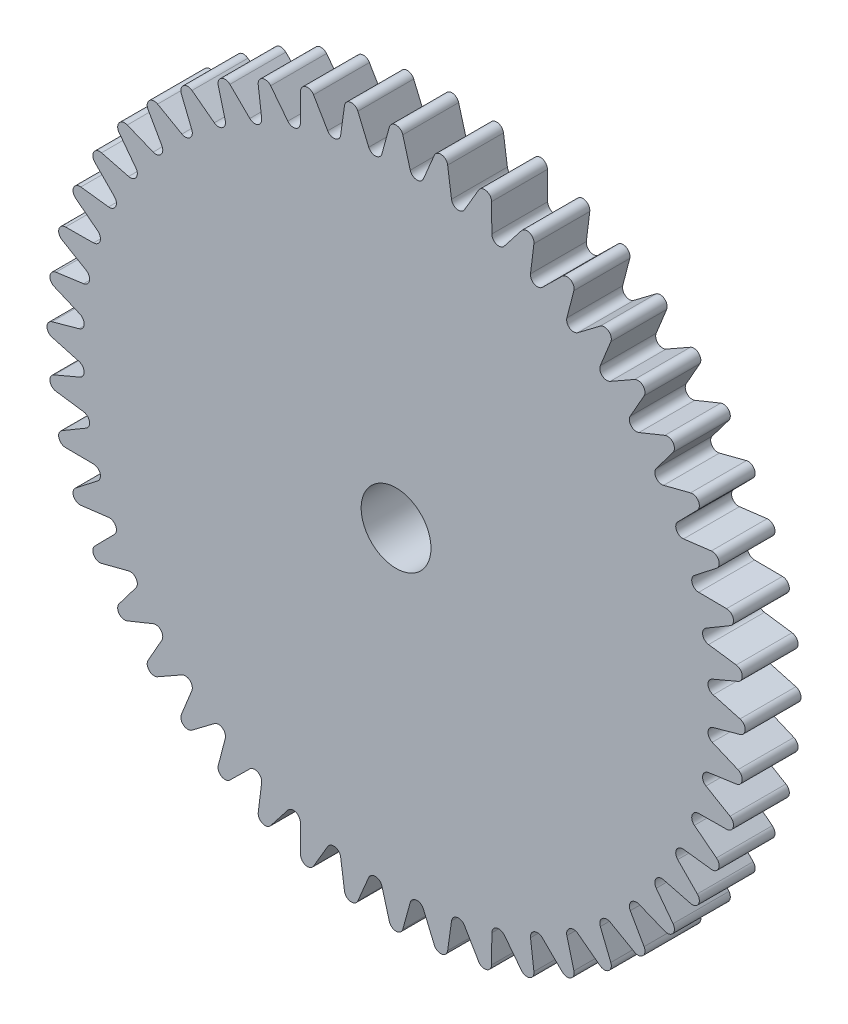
from build123d import *

# Parameters (mm, degrees)
BASE_EXTRUSION_DEPTH         = 2
R_P_TITION_CIRCULAIRE4_COUNT = 48


with BuildPart() as part:
    # Esquisse2 → Base-Extrusion (new body)
    with BuildSketch(Plane.XY.offset(-1.968079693)):
        with BuildLine():
            Line((-0.081753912, 1.247323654), (-0.732120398, 11.169998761))
            ThreePointArc((-0.732120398, 11.169998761), (-0.590649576, 11.225576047), (-0.507516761, 11.352822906))
            Line((-0.507516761, 11.352822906), (-0.24095442, 12.316640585))
            ThreePointArc((-0.24095442, 12.316640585), (0, 12.5), (0.24095442, 12.316640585))
            Line((0.24095442, 12.316640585), (0.507516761, 11.352822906))
            ThreePointArc((0.507516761, 11.352822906), (0.590649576, 11.225576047), (0.732120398, 11.169998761))
            Line((0.732120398, 11.169998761), (0.081753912, 1.247323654))
            ThreePointArc((0.081753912, 1.247323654), (0, 1.25), (-0.081753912, 1.247323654))
        make_face()
    base_extrusion = extrude(amount=BASE_EXTRUSION_DEPTH)

    # R_p_tition circulaire4: Base-Extrusion ×48 about axis
    r_p_tition_circulaire4_axis = Axis((0, 0, 0.031920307), (0, 0, -1))
    for i in range(1, R_P_TITION_CIRCULAIRE4_COUNT):
        add(base_extrusion.rotate(r_p_tition_circulaire4_axis, i * 360 / R_P_TITION_CIRCULAIRE4_COUNT))


solid = part.part
